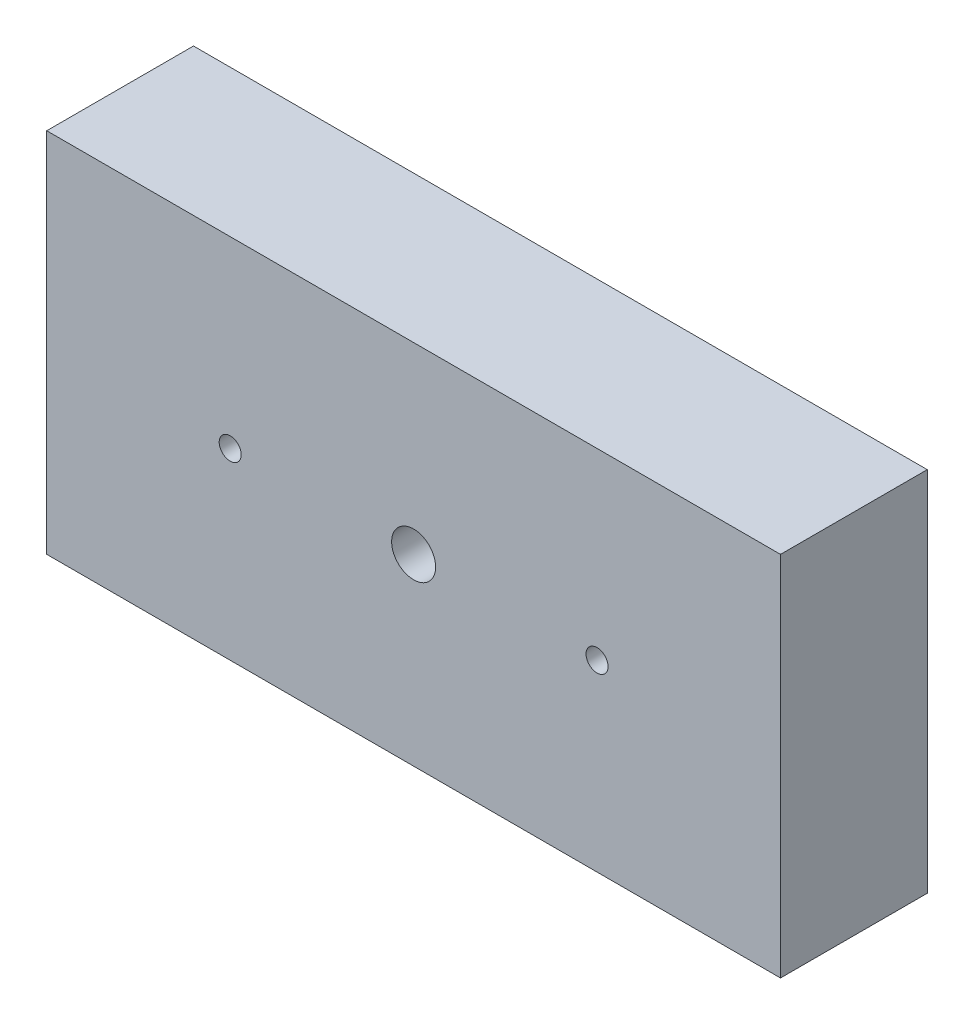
ISO-10303-21;
HEADER;
FILE_DESCRIPTION(('STEP AP214'),'2;1');
FILE_NAME('part.step','',(''),(''),'','','');
FILE_SCHEMA(('AUTOMOTIVE_DESIGN { 1 0 10303 214 1 1 1 1 }'));
ENDSEC;
DATA;
#1=APPLICATION_CONTEXT('core data for automotive mechanical design processes');
#2=APPLICATION_PROTOCOL_DEFINITION('international standard','automotive_design',2000,#1);
#3=PRODUCT_CONTEXT('',#1,'mechanical');
#4=PRODUCT('Part','Part','',(#3));
#5=PRODUCT_RELATED_PRODUCT_CATEGORY('part','',(#4));
#6=PRODUCT_DEFINITION_FORMATION('','',#4);
#7=PRODUCT_DEFINITION_CONTEXT('part definition',#1,'design');
#8=PRODUCT_DEFINITION('design','',#6,#7);
#9=PRODUCT_DEFINITION_SHAPE('','',#8);
#10=(LENGTH_UNIT() NAMED_UNIT(*) SI_UNIT(.MILLI.,.METRE.));
#11=(NAMED_UNIT(*) PLANE_ANGLE_UNIT() SI_UNIT($,.RADIAN.));
#12=(NAMED_UNIT(*) SI_UNIT($,.STERADIAN.) SOLID_ANGLE_UNIT());
#13=UNCERTAINTY_MEASURE_WITH_UNIT(LENGTH_MEASURE(1.E-05),#10,'distance_accuracy_value','');
#14=(GEOMETRIC_REPRESENTATION_CONTEXT(3) GLOBAL_UNCERTAINTY_ASSIGNED_CONTEXT((#13)) GLOBAL_UNIT_ASSIGNED_CONTEXT((#10,
#11,#12)) REPRESENTATION_CONTEXT('',''));
#15=CARTESIAN_POINT('',(0.,0.,0.));
#16=DIRECTION('',(0.,0.,1.));
#17=DIRECTION('',(1.,0.,0.));
#18=AXIS2_PLACEMENT_3D('',#15,#16,#17);
#19=CARTESIAN_POINT('',(0.,0.,10.));
#20=DIRECTION('',(0.,0.,-1.));
#21=DIRECTION('',(-1.,0.,0.));
#22=AXIS2_PLACEMENT_3D('',#19,#20,#21);
#23=PLANE('',#22);
#24=CARTESIAN_POINT('',(25.,12.5,10.));
#25=DIRECTION('',(0.,0.,1.));
#26=DIRECTION('',(1.,0.,0.));
#27=AXIS2_PLACEMENT_3D('',#24,#25,#26);
#28=CIRCLE('',#27,1.5);
#29=CARTESIAN_POINT('',(26.5,12.5,10.));
#30=VERTEX_POINT('',#29);
#31=EDGE_CURVE('E124',#30,#30,#28,.T.);
#32=ORIENTED_EDGE('',*,*,#31,.F.);
#33=EDGE_LOOP('',(#32));
#34=FACE_BOUND('',#33,.T.);
#35=DIRECTION('',(0.,-1.,0.));
#36=VECTOR('',#35,1.);
#37=CARTESIAN_POINT('',(0.,0.,10.));
#38=LINE('',#37,#36);
#39=CARTESIAN_POINT('',(0.,25.,10.));
#40=VERTEX_POINT('',#39);
#41=CARTESIAN_POINT('',(0.,0.,10.));
#42=VERTEX_POINT('',#41);
#43=EDGE_CURVE('E85',#40,#42,#38,.T.);
#44=ORIENTED_EDGE('',*,*,#43,.T.);
#45=DIRECTION('',(1.,0.,0.));
#46=VECTOR('',#45,1.);
#47=CARTESIAN_POINT('',(0.,0.,10.));
#48=LINE('',#47,#46);
#49=CARTESIAN_POINT('',(50.,0.,10.));
#50=VERTEX_POINT('',#49);
#51=EDGE_CURVE('E80',#42,#50,#48,.T.);
#52=ORIENTED_EDGE('',*,*,#51,.T.);
#53=DIRECTION('',(0.,1.,0.));
#54=VECTOR('',#53,1.);
#55=CARTESIAN_POINT('',(50.,0.,10.));
#56=LINE('',#55,#54);
#57=CARTESIAN_POINT('',(50.,25.,10.));
#58=VERTEX_POINT('',#57);
#59=EDGE_CURVE('E83',#50,#58,#56,.T.);
#60=ORIENTED_EDGE('',*,*,#59,.T.);
#61=DIRECTION('',(-1.,0.,0.));
#62=VECTOR('',#61,1.);
#63=CARTESIAN_POINT('',(0.,25.,10.));
#64=LINE('',#63,#62);
#65=EDGE_CURVE('E50',#58,#40,#64,.T.);
#66=ORIENTED_EDGE('',*,*,#65,.T.);
#67=EDGE_LOOP('',(#44,#52,#60,#66));
#68=FACE_BOUND('',#67,.T.);
#69=CARTESIAN_POINT('',(12.5,12.5,10.));
#70=DIRECTION('',(0.,0.,1.));
#71=DIRECTION('',(1.,0.,0.));
#72=AXIS2_PLACEMENT_3D('',#69,#70,#71);
#73=CIRCLE('',#72,0.75);
#74=CARTESIAN_POINT('',(13.25,12.5,10.));
#75=VERTEX_POINT('',#74);
#76=EDGE_CURVE('E100',#75,#75,#73,.T.);
#77=ORIENTED_EDGE('',*,*,#76,.F.);
#78=EDGE_LOOP('',(#77));
#79=FACE_BOUND('',#78,.T.);
#80=CARTESIAN_POINT('',(37.5,12.5,10.));
#81=DIRECTION('',(0.,0.,1.));
#82=DIRECTION('',(1.,0.,0.));
#83=AXIS2_PLACEMENT_3D('',#80,#81,#82);
#84=CIRCLE('',#83,0.749999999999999);
#85=CARTESIAN_POINT('',(38.25,12.5,10.));
#86=VERTEX_POINT('',#85);
#87=EDGE_CURVE('E115',#86,#86,#84,.T.);
#88=ORIENTED_EDGE('',*,*,#87,.F.);
#89=EDGE_LOOP('',(#88));
#90=FACE_BOUND('',#89,.T.);
#91=ADVANCED_FACE('F33',(#34,#68,#79,#90),#23,.F.);
#92=CARTESIAN_POINT('',(0.,0.,0.));
#93=DIRECTION('',(0.,0.,-1.));
#94=DIRECTION('',(-1.,0.,0.));
#95=AXIS2_PLACEMENT_3D('',#92,#93,#94);
#96=PLANE('',#95);
#97=CARTESIAN_POINT('',(25.,12.5,0.));
#98=DIRECTION('',(0.,0.,1.));
#99=DIRECTION('',(1.,0.,0.));
#100=AXIS2_PLACEMENT_3D('',#97,#98,#99);
#101=CIRCLE('',#100,1.5);
#102=CARTESIAN_POINT('',(26.5,12.5,0.));
#103=VERTEX_POINT('',#102);
#104=EDGE_CURVE('E121',#103,#103,#101,.T.);
#105=ORIENTED_EDGE('',*,*,#104,.T.);
#106=EDGE_LOOP('',(#105));
#107=FACE_BOUND('',#106,.T.);
#108=CARTESIAN_POINT('',(12.5,12.5,0.));
#109=DIRECTION('',(0.,0.,1.));
#110=DIRECTION('',(1.,0.,0.));
#111=AXIS2_PLACEMENT_3D('',#108,#109,#110);
#112=CIRCLE('',#111,0.75);
#113=CARTESIAN_POINT('',(13.25,12.5,0.));
#114=VERTEX_POINT('',#113);
#115=EDGE_CURVE('E112',#114,#114,#112,.T.);
#116=ORIENTED_EDGE('',*,*,#115,.T.);
#117=EDGE_LOOP('',(#116));
#118=FACE_BOUND('',#117,.T.);
#119=DIRECTION('',(0.,-1.,0.));
#120=VECTOR('',#119,1.);
#121=CARTESIAN_POINT('',(0.,0.,0.));
#122=LINE('',#121,#120);
#123=CARTESIAN_POINT('',(0.,25.,0.));
#124=VERTEX_POINT('',#123);
#125=CARTESIAN_POINT('',(0.,0.,0.));
#126=VERTEX_POINT('',#125);
#127=EDGE_CURVE('E97',#124,#126,#122,.T.);
#128=ORIENTED_EDGE('',*,*,#127,.F.);
#129=DIRECTION('',(-1.,0.,0.));
#130=VECTOR('',#129,1.);
#131=CARTESIAN_POINT('',(0.,25.,0.));
#132=LINE('',#131,#130);
#133=CARTESIAN_POINT('',(50.,25.,0.));
#134=VERTEX_POINT('',#133);
#135=EDGE_CURVE('E73',#134,#124,#132,.T.);
#136=ORIENTED_EDGE('',*,*,#135,.F.);
#137=DIRECTION('',(0.,1.,0.));
#138=VECTOR('',#137,1.);
#139=CARTESIAN_POINT('',(50.,0.,0.));
#140=LINE('',#139,#138);
#141=CARTESIAN_POINT('',(50.,0.,0.));
#142=VERTEX_POINT('',#141);
#143=EDGE_CURVE('E67',#142,#134,#140,.T.);
#144=ORIENTED_EDGE('',*,*,#143,.F.);
#145=DIRECTION('',(1.,0.,0.));
#146=VECTOR('',#145,1.);
#147=CARTESIAN_POINT('',(0.,0.,0.));
#148=LINE('',#147,#146);
#149=EDGE_CURVE('E89',#126,#142,#148,.T.);
#150=ORIENTED_EDGE('',*,*,#149,.F.);
#151=EDGE_LOOP('',(#128,#136,#144,#150));
#152=FACE_BOUND('',#151,.T.);
#153=CARTESIAN_POINT('',(37.5,12.5,0.));
#154=DIRECTION('',(0.,0.,1.));
#155=DIRECTION('',(1.,0.,0.));
#156=AXIS2_PLACEMENT_3D('',#153,#154,#155);
#157=CIRCLE('',#156,0.749999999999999);
#158=CARTESIAN_POINT('',(38.25,12.5,0.));
#159=VERTEX_POINT('',#158);
#160=EDGE_CURVE('E118',#159,#159,#157,.T.);
#161=ORIENTED_EDGE('',*,*,#160,.T.);
#162=EDGE_LOOP('',(#161));
#163=FACE_BOUND('',#162,.T.);
#164=ADVANCED_FACE('F108',(#107,#118,#152,#163),#96,.T.);
#165=CARTESIAN_POINT('',(0.,0.,10.));
#166=DIRECTION('',(1.,0.,0.));
#167=DIRECTION('',(0.,0.,-1.));
#168=AXIS2_PLACEMENT_3D('',#165,#166,#167);
#169=PLANE('',#168);
#170=ORIENTED_EDGE('',*,*,#127,.T.);
#171=DIRECTION('',(0.,0.,-1.));
#172=VECTOR('',#171,1.);
#173=CARTESIAN_POINT('',(0.,0.,10.));
#174=LINE('',#173,#172);
#175=EDGE_CURVE('E11',#42,#126,#174,.T.);
#176=ORIENTED_EDGE('',*,*,#175,.F.);
#177=ORIENTED_EDGE('',*,*,#43,.F.);
#178=DIRECTION('',(0.,0.,-1.));
#179=VECTOR('',#178,1.);
#180=CARTESIAN_POINT('',(0.,25.,10.));
#181=LINE('',#180,#179);
#182=EDGE_CURVE('E93',#40,#124,#181,.T.);
#183=ORIENTED_EDGE('',*,*,#182,.T.);
#184=EDGE_LOOP('',(#170,#176,#177,#183));
#185=FACE_BOUND('',#184,.T.);
#186=ADVANCED_FACE('F35',(#185),#169,.F.);
#187=CARTESIAN_POINT('',(0.,0.,10.));
#188=DIRECTION('',(0.,1.,0.));
#189=DIRECTION('',(0.,0.,1.));
#190=AXIS2_PLACEMENT_3D('',#187,#188,#189);
#191=PLANE('',#190);
#192=ORIENTED_EDGE('',*,*,#149,.T.);
#193=DIRECTION('',(0.,0.,-1.));
#194=VECTOR('',#193,1.);
#195=CARTESIAN_POINT('',(50.,0.,10.));
#196=LINE('',#195,#194);
#197=EDGE_CURVE('E42',#50,#142,#196,.T.);
#198=ORIENTED_EDGE('',*,*,#197,.F.);
#199=ORIENTED_EDGE('',*,*,#51,.F.);
#200=ORIENTED_EDGE('',*,*,#175,.T.);
#201=EDGE_LOOP('',(#192,#198,#199,#200));
#202=FACE_BOUND('',#201,.T.);
#203=ADVANCED_FACE('F88',(#202),#191,.F.);
#204=CARTESIAN_POINT('',(50.,0.,10.));
#205=DIRECTION('',(-1.,0.,0.));
#206=DIRECTION('',(0.,0.,1.));
#207=AXIS2_PLACEMENT_3D('',#204,#205,#206);
#208=PLANE('',#207);
#209=ORIENTED_EDGE('',*,*,#143,.T.);
#210=DIRECTION('',(0.,0.,-1.));
#211=VECTOR('',#210,1.);
#212=CARTESIAN_POINT('',(50.,25.,10.));
#213=LINE('',#212,#211);
#214=EDGE_CURVE('E90',#58,#134,#213,.T.);
#215=ORIENTED_EDGE('',*,*,#214,.F.);
#216=ORIENTED_EDGE('',*,*,#59,.F.);
#217=ORIENTED_EDGE('',*,*,#197,.T.);
#218=EDGE_LOOP('',(#209,#215,#216,#217));
#219=FACE_BOUND('',#218,.T.);
#220=ADVANCED_FACE('F91',(#219),#208,.F.);
#221=CARTESIAN_POINT('',(0.,25.,10.));
#222=DIRECTION('',(0.,-1.,0.));
#223=DIRECTION('',(0.,0.,-1.));
#224=AXIS2_PLACEMENT_3D('',#221,#222,#223);
#225=PLANE('',#224);
#226=ORIENTED_EDGE('',*,*,#135,.T.);
#227=ORIENTED_EDGE('',*,*,#182,.F.);
#228=ORIENTED_EDGE('',*,*,#65,.F.);
#229=ORIENTED_EDGE('',*,*,#214,.T.);
#230=EDGE_LOOP('',(#226,#227,#228,#229));
#231=FACE_BOUND('',#230,.T.);
#232=ADVANCED_FACE('F105',(#231),#225,.F.);
#233=CARTESIAN_POINT('',(12.5,12.5,10.));
#234=DIRECTION('',(0.,0.,-1.));
#235=DIRECTION('',(-1.,0.,0.));
#236=AXIS2_PLACEMENT_3D('',#233,#234,#235);
#237=CYLINDRICAL_SURFACE('',#236,0.75);
#238=ORIENTED_EDGE('',*,*,#76,.T.);
#239=EDGE_LOOP('',(#238));
#240=FACE_BOUND('',#239,.T.);
#241=ORIENTED_EDGE('',*,*,#115,.F.);
#242=EDGE_LOOP('',(#241));
#243=FACE_BOUND('',#242,.T.);
#244=ADVANCED_FACE('F147',(#240,#243),#237,.F.);
#245=CARTESIAN_POINT('',(37.5,12.5,10.));
#246=DIRECTION('',(0.,0.,-1.));
#247=DIRECTION('',(-1.,0.,0.));
#248=AXIS2_PLACEMENT_3D('',#245,#246,#247);
#249=CYLINDRICAL_SURFACE('',#248,0.749999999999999);
#250=ORIENTED_EDGE('',*,*,#87,.T.);
#251=EDGE_LOOP('',(#250));
#252=FACE_BOUND('',#251,.T.);
#253=ORIENTED_EDGE('',*,*,#160,.F.);
#254=EDGE_LOOP('',(#253));
#255=FACE_BOUND('',#254,.T.);
#256=ADVANCED_FACE('F135',(#252,#255),#249,.F.);
#257=CARTESIAN_POINT('',(25.,12.5,0.));
#258=DIRECTION('',(0.,0.,1.));
#259=DIRECTION('',(1.,0.,0.));
#260=AXIS2_PLACEMENT_3D('',#257,#258,#259);
#261=CYLINDRICAL_SURFACE('',#260,1.5);
#262=ORIENTED_EDGE('',*,*,#104,.F.);
#263=EDGE_LOOP('',(#262));
#264=FACE_BOUND('',#263,.T.);
#265=ORIENTED_EDGE('',*,*,#31,.T.);
#266=EDGE_LOOP('',(#265));
#267=FACE_BOUND('',#266,.T.);
#268=ADVANCED_FACE('F132',(#264,#267),#261,.F.);
#269=CLOSED_SHELL('',(#91,#164,#186,#203,#220,#232,#244,#256,#268));
#270=MANIFOLD_SOLID_BREP('B2',#269);
#271=ADVANCED_BREP_SHAPE_REPRESENTATION('',(#18,#270),#14);
#272=SHAPE_DEFINITION_REPRESENTATION(#9,#271);
ENDSEC;
END-ISO-10303-21;
